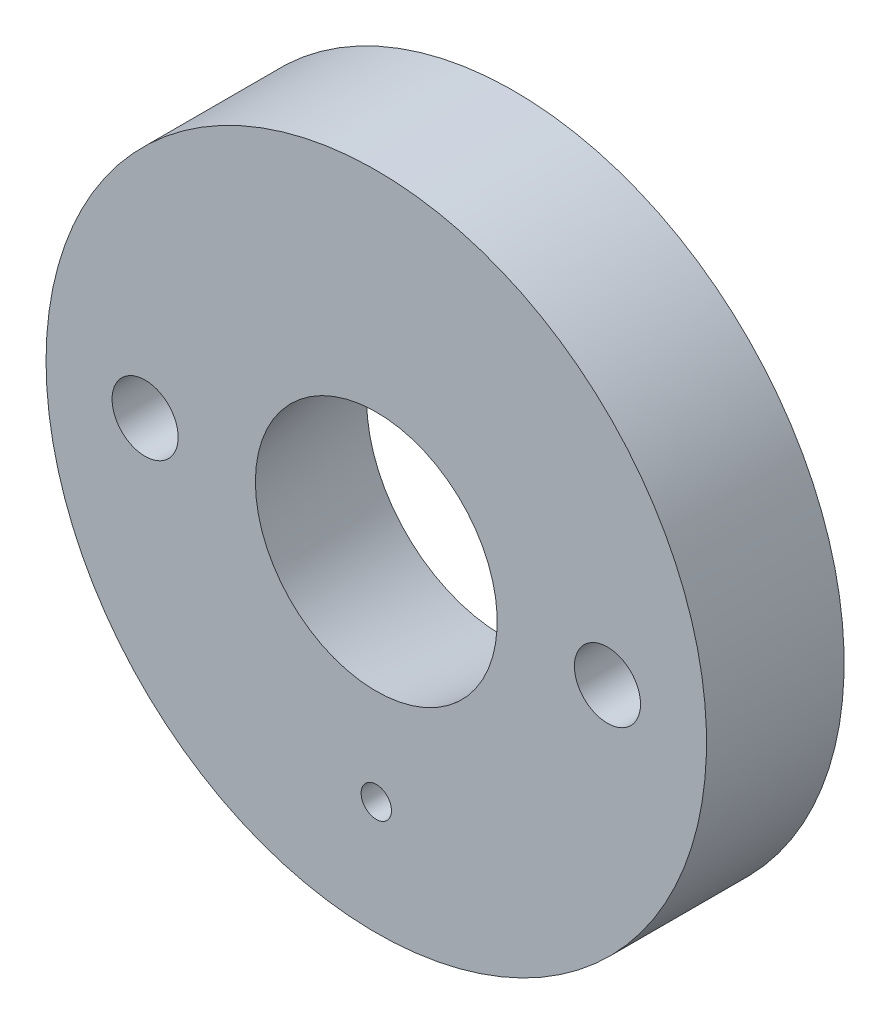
from build123d import *

# Parameters (mm, degrees)
SKETCH5_R          = 1.525
CUT_EXTRUDE1_DEPTH = 10
SKETCH6_R          = 7.62
CUT_EXTRUDE2_DEPTH = 0.508
SKETCH7_R          = 0.7
CUT_EXTRUDE3_DEPTH = 23.468593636


with BuildPart() as part:
    # Sketch4 → Revolve1 (revolve)
    with BuildSketch(Plane(origin=(0, 0, 0), x_dir=(1, 0, 0), z_dir=(0, 1, 0))):
        Polygon((-15.24, 6.35), (-15.24, 0), (-5.58, 0), (-6.35, 6.35), align=None)
    revolve(axis=Axis((0, 0, -11.370930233), (0, 0, 1)))

    # Sketch5 → Cut-Extrude1 (cut)
    with BuildSketch(Plane(origin=(0, 0, -6.35), x_dir=(-1, 0, 0), z_dir=(0, 0, -1))):
        with Locations((10.668, 0)):
            Circle(SKETCH5_R)
        with Locations((-10.668, 0)):
            Circle(SKETCH5_R)
    extrude(amount=-CUT_EXTRUDE1_DEPTH, mode=Mode.SUBTRACT)

    # Sketch6 → Cut-Extrude2 (cut)
    with BuildSketch(Plane(origin=(0, 0, -6.35), x_dir=(-1, 0, 0), z_dir=(0, 0, -1))):
        Circle(SKETCH6_R)
    extrude(amount=-CUT_EXTRUDE2_DEPTH, mode=Mode.SUBTRACT)

    # Sketch7 → Cut-Extrude3 (cut, through all)
    with BuildSketch(Plane.XY):
        with Locations((0, -10)):
            Circle(SKETCH7_R)
    extrude(amount=-CUT_EXTRUDE3_DEPTH, mode=Mode.SUBTRACT)


solid = part.part
